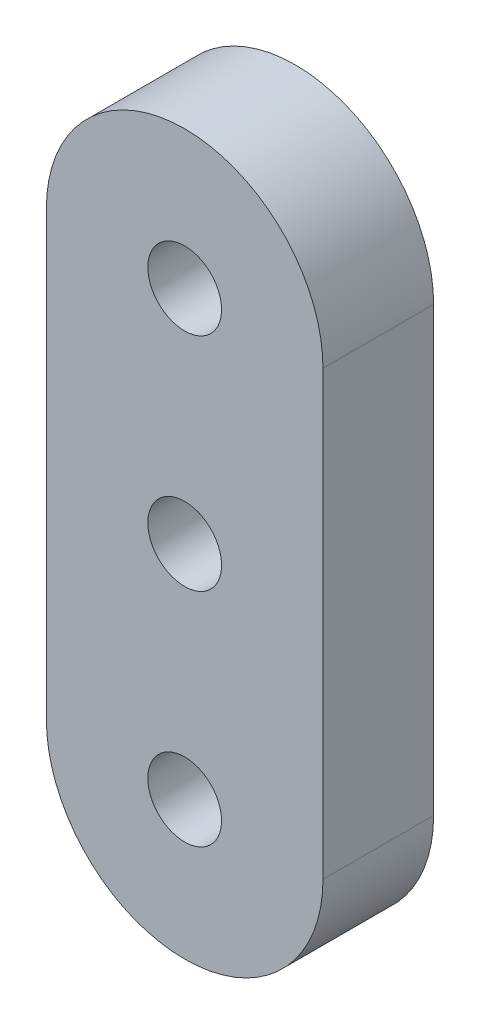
ISO-10303-21;
HEADER;
FILE_DESCRIPTION(('STEP AP214'),'2;1');
FILE_NAME('part.step','',(''),(''),'','','');
FILE_SCHEMA(('AUTOMOTIVE_DESIGN { 1 0 10303 214 1 1 1 1 }'));
ENDSEC;
DATA;
#1=APPLICATION_CONTEXT('core data for automotive mechanical design processes');
#2=APPLICATION_PROTOCOL_DEFINITION('international standard','automotive_design',2000,#1);
#3=PRODUCT_CONTEXT('',#1,'mechanical');
#4=PRODUCT('Part','Part','',(#3));
#5=PRODUCT_RELATED_PRODUCT_CATEGORY('part','',(#4));
#6=PRODUCT_DEFINITION_FORMATION('','',#4);
#7=PRODUCT_DEFINITION_CONTEXT('part definition',#1,'design');
#8=PRODUCT_DEFINITION('design','',#6,#7);
#9=PRODUCT_DEFINITION_SHAPE('','',#8);
#10=(LENGTH_UNIT() NAMED_UNIT(*) SI_UNIT(.MILLI.,.METRE.));
#11=(NAMED_UNIT(*) PLANE_ANGLE_UNIT() SI_UNIT($,.RADIAN.));
#12=(NAMED_UNIT(*) SI_UNIT($,.STERADIAN.) SOLID_ANGLE_UNIT());
#13=UNCERTAINTY_MEASURE_WITH_UNIT(LENGTH_MEASURE(1.E-05),#10,'distance_accuracy_value','');
#14=(GEOMETRIC_REPRESENTATION_CONTEXT(3) GLOBAL_UNCERTAINTY_ASSIGNED_CONTEXT((#13)) GLOBAL_UNIT_ASSIGNED_CONTEXT((#10,
#11,#12)) REPRESENTATION_CONTEXT('',''));
#15=CARTESIAN_POINT('',(0.,0.,0.));
#16=DIRECTION('',(0.,0.,1.));
#17=DIRECTION('',(1.,0.,0.));
#18=AXIS2_PLACEMENT_3D('',#15,#16,#17);
#19=CARTESIAN_POINT('',(0.,0.,17.5));
#20=DIRECTION('',(0.,0.,-1.));
#21=DIRECTION('',(-1.,0.,0.));
#22=AXIS2_PLACEMENT_3D('',#19,#20,#21);
#23=CYLINDRICAL_SURFACE('',#22,2.);
#24=CARTESIAN_POINT('',(0.,0.,-11.5));
#25=DIRECTION('',(0.,0.,-1.));
#26=DIRECTION('',(-1.,0.,0.));
#27=AXIS2_PLACEMENT_3D('',#24,#25,#26);
#28=CIRCLE('',#27,2.);
#29=CARTESIAN_POINT('',(-2.,0.,-11.5));
#30=VERTEX_POINT('',#29);
#31=EDGE_CURVE('E81',#30,#30,#28,.T.);
#32=ORIENTED_EDGE('',*,*,#31,.F.);
#33=EDGE_LOOP('',(#32));
#34=FACE_BOUND('',#33,.T.);
#35=CARTESIAN_POINT('',(0.,0.,-17.5));
#36=DIRECTION('',(0.,0.,1.));
#37=DIRECTION('',(1.,0.,0.));
#38=AXIS2_PLACEMENT_3D('',#35,#36,#37);
#39=CIRCLE('',#38,2.);
#40=CARTESIAN_POINT('',(2.,0.,-17.5));
#41=VERTEX_POINT('',#40);
#42=EDGE_CURVE('E118',#41,#41,#39,.T.);
#43=ORIENTED_EDGE('',*,*,#42,.F.);
#44=EDGE_LOOP('',(#43));
#45=FACE_BOUND('',#44,.T.);
#46=ADVANCED_FACE('F32',(#34,#45),#23,.F.);
#47=CARTESIAN_POINT('',(0.,12.,-17.5));
#48=DIRECTION('',(0.,0.,1.));
#49=DIRECTION('',(1.,0.,0.));
#50=AXIS2_PLACEMENT_3D('',#47,#48,#49);
#51=PLANE('',#50);
#52=CARTESIAN_POINT('',(0.,12.,-17.5));
#53=DIRECTION('',(0.,0.,1.));
#54=DIRECTION('',(1.,0.,0.));
#55=AXIS2_PLACEMENT_3D('',#52,#53,#54);
#56=CIRCLE('',#55,7.5);
#57=CARTESIAN_POINT('',(7.5,12.,-17.5));
#58=VERTEX_POINT('',#57);
#59=CARTESIAN_POINT('',(-7.5,12.,-17.5));
#60=VERTEX_POINT('',#59);
#61=EDGE_CURVE('E106',#58,#60,#56,.T.);
#62=ORIENTED_EDGE('',*,*,#61,.F.);
#63=DIRECTION('',(0.,1.,0.));
#64=VECTOR('',#63,1.);
#65=CARTESIAN_POINT('',(7.5,12.,-17.5));
#66=LINE('',#65,#64);
#67=CARTESIAN_POINT('',(7.5,-12.,-17.5));
#68=VERTEX_POINT('',#67);
#69=EDGE_CURVE('E86',#68,#58,#66,.T.);
#70=ORIENTED_EDGE('',*,*,#69,.F.);
#71=CARTESIAN_POINT('',(0.,-12.,-17.5));
#72=DIRECTION('',(0.,0.,1.));
#73=DIRECTION('',(1.,0.,0.));
#74=AXIS2_PLACEMENT_3D('',#71,#72,#73);
#75=CIRCLE('',#74,7.5);
#76=CARTESIAN_POINT('',(-7.5,-12.,-17.5));
#77=VERTEX_POINT('',#76);
#78=EDGE_CURVE('E91',#77,#68,#75,.T.);
#79=ORIENTED_EDGE('',*,*,#78,.F.);
#80=DIRECTION('',(0.,-1.,0.));
#81=VECTOR('',#80,1.);
#82=CARTESIAN_POINT('',(-7.5,12.,-17.5));
#83=LINE('',#82,#81);
#84=EDGE_CURVE('E103',#60,#77,#83,.T.);
#85=ORIENTED_EDGE('',*,*,#84,.F.);
#86=EDGE_LOOP('',(#62,#70,#79,#85));
#87=FACE_BOUND('',#86,.T.);
#88=CARTESIAN_POINT('',(0.,12.,-17.5));
#89=DIRECTION('',(0.,0.,1.));
#90=DIRECTION('',(1.,0.,0.));
#91=AXIS2_PLACEMENT_3D('',#88,#89,#90);
#92=CIRCLE('',#91,2.);
#93=CARTESIAN_POINT('',(2.,12.,-17.5));
#94=VERTEX_POINT('',#93);
#95=EDGE_CURVE('E112',#94,#94,#92,.T.);
#96=ORIENTED_EDGE('',*,*,#95,.T.);
#97=EDGE_LOOP('',(#96));
#98=FACE_BOUND('',#97,.T.);
#99=CARTESIAN_POINT('',(0.,-12.,-17.5));
#100=DIRECTION('',(0.,0.,1.));
#101=DIRECTION('',(1.,0.,0.));
#102=AXIS2_PLACEMENT_3D('',#99,#100,#101);
#103=CIRCLE('',#102,2.);
#104=CARTESIAN_POINT('',(2.,-12.,-17.5));
#105=VERTEX_POINT('',#104);
#106=EDGE_CURVE('E115',#105,#105,#103,.T.);
#107=ORIENTED_EDGE('',*,*,#106,.T.);
#108=EDGE_LOOP('',(#107));
#109=FACE_BOUND('',#108,.T.);
#110=ORIENTED_EDGE('',*,*,#42,.T.);
#111=EDGE_LOOP('',(#110));
#112=FACE_BOUND('',#111,.T.);
#113=ADVANCED_FACE('F108',(#87,#98,#109,#112),#51,.F.);
#114=CARTESIAN_POINT('',(0.,12.,17.5));
#115=DIRECTION('',(0.,0.,-1.));
#116=DIRECTION('',(-1.,0.,0.));
#117=AXIS2_PLACEMENT_3D('',#114,#115,#116);
#118=CYLINDRICAL_SURFACE('',#117,7.5);
#119=DIRECTION('',(0.,0.,-1.));
#120=VECTOR('',#119,1.);
#121=CARTESIAN_POINT('',(-7.5,12.,17.5));
#122=LINE('',#121,#120);
#123=CARTESIAN_POINT('',(-7.5,12.,-11.5));
#124=VERTEX_POINT('',#123);
#125=EDGE_CURVE('E11',#124,#60,#122,.T.);
#126=ORIENTED_EDGE('',*,*,#125,.F.);
#127=CARTESIAN_POINT('',(0.,12.,-11.5));
#128=DIRECTION('',(0.,0.,-1.));
#129=DIRECTION('',(-1.,0.,0.));
#130=AXIS2_PLACEMENT_3D('',#127,#128,#129);
#131=CIRCLE('',#130,7.5);
#132=CARTESIAN_POINT('',(7.5,12.,-11.5));
#133=VERTEX_POINT('',#132);
#134=EDGE_CURVE('E74',#124,#133,#131,.T.);
#135=ORIENTED_EDGE('',*,*,#134,.T.);
#136=DIRECTION('',(0.,0.,-1.));
#137=VECTOR('',#136,1.);
#138=CARTESIAN_POINT('',(7.5,12.,17.5));
#139=LINE('',#138,#137);
#140=EDGE_CURVE('E56',#133,#58,#139,.T.);
#141=ORIENTED_EDGE('',*,*,#140,.T.);
#142=ORIENTED_EDGE('',*,*,#61,.T.);
#143=EDGE_LOOP('',(#126,#135,#141,#142));
#144=FACE_BOUND('',#143,.T.);
#145=ADVANCED_FACE('F34',(#144),#118,.T.);
#146=CARTESIAN_POINT('',(-7.5,12.,17.5));
#147=DIRECTION('',(1.,0.,0.));
#148=DIRECTION('',(0.,1.,0.));
#149=AXIS2_PLACEMENT_3D('',#146,#147,#148);
#150=PLANE('',#149);
#151=DIRECTION('',(0.,0.,-1.));
#152=VECTOR('',#151,1.);
#153=CARTESIAN_POINT('',(-7.5,-12.,17.5));
#154=LINE('',#153,#152);
#155=CARTESIAN_POINT('',(-7.5,-12.,-11.5));
#156=VERTEX_POINT('',#155);
#157=EDGE_CURVE('E41',#156,#77,#154,.T.);
#158=ORIENTED_EDGE('',*,*,#157,.F.);
#159=DIRECTION('',(0.,1.,0.));
#160=VECTOR('',#159,1.);
#161=CARTESIAN_POINT('',(-7.5,12.,-11.5));
#162=LINE('',#161,#160);
#163=EDGE_CURVE('E82',#156,#124,#162,.T.);
#164=ORIENTED_EDGE('',*,*,#163,.T.);
#165=ORIENTED_EDGE('',*,*,#125,.T.);
#166=ORIENTED_EDGE('',*,*,#84,.T.);
#167=EDGE_LOOP('',(#158,#164,#165,#166));
#168=FACE_BOUND('',#167,.T.);
#169=ADVANCED_FACE('F104',(#168),#150,.F.);
#170=CARTESIAN_POINT('',(0.,-12.,17.5));
#171=DIRECTION('',(0.,0.,-1.));
#172=DIRECTION('',(-1.,0.,0.));
#173=AXIS2_PLACEMENT_3D('',#170,#171,#172);
#174=CYLINDRICAL_SURFACE('',#173,7.5);
#175=DIRECTION('',(0.,0.,-1.));
#176=VECTOR('',#175,1.);
#177=CARTESIAN_POINT('',(7.5,-12.,17.5));
#178=LINE('',#177,#176);
#179=CARTESIAN_POINT('',(7.5,-12.,-11.5));
#180=VERTEX_POINT('',#179);
#181=EDGE_CURVE('E88',#180,#68,#178,.T.);
#182=ORIENTED_EDGE('',*,*,#181,.F.);
#183=CARTESIAN_POINT('',(0.,-12.,-11.5));
#184=DIRECTION('',(0.,0.,-1.));
#185=DIRECTION('',(-1.,0.,0.));
#186=AXIS2_PLACEMENT_3D('',#183,#184,#185);
#187=CIRCLE('',#186,7.5);
#188=EDGE_CURVE('E48',#180,#156,#187,.T.);
#189=ORIENTED_EDGE('',*,*,#188,.T.);
#190=ORIENTED_EDGE('',*,*,#157,.T.);
#191=ORIENTED_EDGE('',*,*,#78,.T.);
#192=EDGE_LOOP('',(#182,#189,#190,#191));
#193=FACE_BOUND('',#192,.T.);
#194=ADVANCED_FACE('F99',(#193),#174,.T.);
#195=CARTESIAN_POINT('',(7.5,12.,17.5));
#196=DIRECTION('',(-1.,0.,0.));
#197=DIRECTION('',(0.,-1.,0.));
#198=AXIS2_PLACEMENT_3D('',#195,#196,#197);
#199=PLANE('',#198);
#200=ORIENTED_EDGE('',*,*,#140,.F.);
#201=DIRECTION('',(0.,-1.,0.));
#202=VECTOR('',#201,1.);
#203=CARTESIAN_POINT('',(7.5,12.,-11.5));
#204=LINE('',#203,#202);
#205=EDGE_CURVE('E72',#133,#180,#204,.T.);
#206=ORIENTED_EDGE('',*,*,#205,.T.);
#207=ORIENTED_EDGE('',*,*,#181,.T.);
#208=ORIENTED_EDGE('',*,*,#69,.T.);
#209=EDGE_LOOP('',(#200,#206,#207,#208));
#210=FACE_BOUND('',#209,.T.);
#211=ADVANCED_FACE('F84',(#210),#199,.F.);
#212=CARTESIAN_POINT('',(0.,12.,17.5));
#213=DIRECTION('',(0.,0.,-1.));
#214=DIRECTION('',(-1.,0.,0.));
#215=AXIS2_PLACEMENT_3D('',#212,#213,#214);
#216=CYLINDRICAL_SURFACE('',#215,2.);
#217=CARTESIAN_POINT('',(0.,12.,-11.5));
#218=DIRECTION('',(0.,0.,-1.));
#219=DIRECTION('',(-1.,0.,0.));
#220=AXIS2_PLACEMENT_3D('',#217,#218,#219);
#221=CIRCLE('',#220,2.);
#222=CARTESIAN_POINT('',(-2.,12.,-11.5));
#223=VERTEX_POINT('',#222);
#224=EDGE_CURVE('E78',#223,#223,#221,.T.);
#225=ORIENTED_EDGE('',*,*,#224,.F.);
#226=EDGE_LOOP('',(#225));
#227=FACE_BOUND('',#226,.T.);
#228=ORIENTED_EDGE('',*,*,#95,.F.);
#229=EDGE_LOOP('',(#228));
#230=FACE_BOUND('',#229,.T.);
#231=ADVANCED_FACE('F135',(#227,#230),#216,.F.);
#232=CARTESIAN_POINT('',(0.,-12.,17.5));
#233=DIRECTION('',(0.,0.,-1.));
#234=DIRECTION('',(-1.,0.,0.));
#235=AXIS2_PLACEMENT_3D('',#232,#233,#234);
#236=CYLINDRICAL_SURFACE('',#235,2.);
#237=CARTESIAN_POINT('',(0.,-12.,-11.5));
#238=DIRECTION('',(0.,0.,-1.));
#239=DIRECTION('',(-1.,0.,0.));
#240=AXIS2_PLACEMENT_3D('',#237,#238,#239);
#241=CIRCLE('',#240,2.);
#242=CARTESIAN_POINT('',(-2.,-12.,-11.5));
#243=VERTEX_POINT('',#242);
#244=EDGE_CURVE('E36',#243,#243,#241,.T.);
#245=ORIENTED_EDGE('',*,*,#244,.F.);
#246=EDGE_LOOP('',(#245));
#247=FACE_BOUND('',#246,.T.);
#248=ORIENTED_EDGE('',*,*,#106,.F.);
#249=EDGE_LOOP('',(#248));
#250=FACE_BOUND('',#249,.T.);
#251=ADVANCED_FACE('F132',(#247,#250),#236,.F.);
#252=CARTESIAN_POINT('',(0.,-12.,-11.5));
#253=DIRECTION('',(0.,0.,-1.));
#254=DIRECTION('',(-1.,0.,0.));
#255=AXIS2_PLACEMENT_3D('',#252,#253,#254);
#256=PLANE('',#255);
#257=ORIENTED_EDGE('',*,*,#31,.T.);
#258=EDGE_LOOP('',(#257));
#259=FACE_BOUND('',#258,.T.);
#260=ORIENTED_EDGE('',*,*,#244,.T.);
#261=EDGE_LOOP('',(#260));
#262=FACE_BOUND('',#261,.T.);
#263=ORIENTED_EDGE('',*,*,#224,.T.);
#264=EDGE_LOOP('',(#263));
#265=FACE_BOUND('',#264,.T.);
#266=ORIENTED_EDGE('',*,*,#163,.F.);
#267=ORIENTED_EDGE('',*,*,#188,.F.);
#268=ORIENTED_EDGE('',*,*,#205,.F.);
#269=ORIENTED_EDGE('',*,*,#134,.F.);
#270=EDGE_LOOP('',(#266,#267,#268,#269));
#271=FACE_BOUND('',#270,.T.);
#272=ADVANCED_FACE('F73',(#259,#262,#265,#271),#256,.F.);
#273=CLOSED_SHELL('',(#46,#113,#145,#169,#194,#211,#231,#251,#272));
#274=MANIFOLD_SOLID_BREP('B2',#273);
#275=ADVANCED_BREP_SHAPE_REPRESENTATION('',(#18,#274),#14);
#276=SHAPE_DEFINITION_REPRESENTATION(#9,#275);
ENDSEC;
END-ISO-10303-21;
